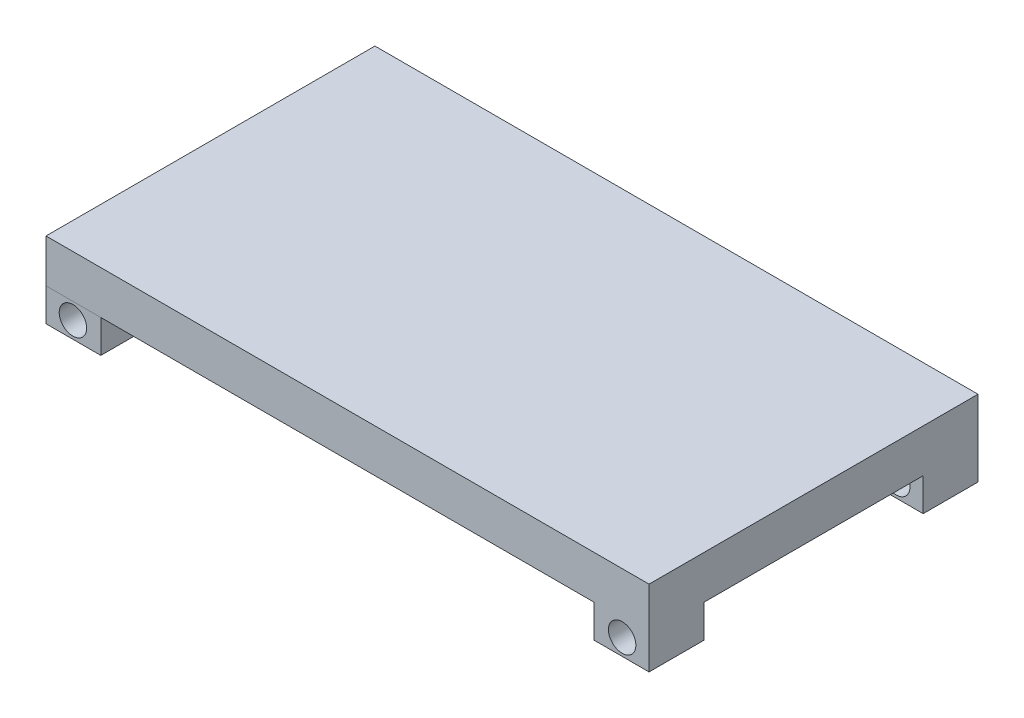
ISO-10303-21;
HEADER;
FILE_DESCRIPTION(('STEP AP214'),'2;1');
FILE_NAME('part.step','',(''),(''),'','','');
FILE_SCHEMA(('AUTOMOTIVE_DESIGN { 1 0 10303 214 1 1 1 1 }'));
ENDSEC;
DATA;
#1=APPLICATION_CONTEXT('core data for automotive mechanical design processes');
#2=APPLICATION_PROTOCOL_DEFINITION('international standard','automotive_design',2000,#1);
#3=PRODUCT_CONTEXT('',#1,'mechanical');
#4=PRODUCT('Part','Part','',(#3));
#5=PRODUCT_RELATED_PRODUCT_CATEGORY('part','',(#4));
#6=PRODUCT_DEFINITION_FORMATION('','',#4);
#7=PRODUCT_DEFINITION_CONTEXT('part definition',#1,'design');
#8=PRODUCT_DEFINITION('design','',#6,#7);
#9=PRODUCT_DEFINITION_SHAPE('','',#8);
#10=(LENGTH_UNIT() NAMED_UNIT(*) SI_UNIT(.MILLI.,.METRE.));
#11=(NAMED_UNIT(*) PLANE_ANGLE_UNIT() SI_UNIT($,.RADIAN.));
#12=(NAMED_UNIT(*) SI_UNIT($,.STERADIAN.) SOLID_ANGLE_UNIT());
#13=UNCERTAINTY_MEASURE_WITH_UNIT(LENGTH_MEASURE(1.E-05),#10,'distance_accuracy_value','');
#14=(GEOMETRIC_REPRESENTATION_CONTEXT(3) GLOBAL_UNCERTAINTY_ASSIGNED_CONTEXT((#13)) GLOBAL_UNIT_ASSIGNED_CONTEXT((#10,
#11,#12)) REPRESENTATION_CONTEXT('',''));
#15=CARTESIAN_POINT('',(0.,0.,0.));
#16=DIRECTION('',(0.,0.,1.));
#17=DIRECTION('',(1.,0.,0.));
#18=AXIS2_PLACEMENT_3D('',#15,#16,#17);
#19=CARTESIAN_POINT('',(0.,-7.62,-76.2));
#20=DIRECTION('',(1.,0.,0.));
#21=DIRECTION('',(0.,0.,1.));
#22=AXIS2_PLACEMENT_3D('',#19,#20,#21);
#23=PLANE('',#22);
#24=DIRECTION('',(0.,0.,1.));
#25=VECTOR('',#24,1.);
#26=CARTESIAN_POINT('',(0.,0.,-76.2));
#27=LINE('',#26,#25);
#28=CARTESIAN_POINT('',(0.,0.,-76.2));
#29=VERTEX_POINT('',#28);
#30=CARTESIAN_POINT('',(0.,0.,-63.5));
#31=VERTEX_POINT('',#30);
#32=EDGE_CURVE('E119',#29,#31,#27,.T.);
#33=ORIENTED_EDGE('',*,*,#32,.F.);
#34=DIRECTION('',(0.,1.,0.));
#35=VECTOR('',#34,1.);
#36=CARTESIAN_POINT('',(0.,-7.62,-76.2));
#37=LINE('',#36,#35);
#38=CARTESIAN_POINT('',(0.,-7.62,-76.2));
#39=VERTEX_POINT('',#38);
#40=EDGE_CURVE('E118',#39,#29,#37,.T.);
#41=ORIENTED_EDGE('',*,*,#40,.F.);
#42=DIRECTION('',(0.,0.,1.));
#43=VECTOR('',#42,1.);
#44=CARTESIAN_POINT('',(0.,-7.62,-76.2));
#45=LINE('',#44,#43);
#46=CARTESIAN_POINT('',(0.,-7.62,-63.5));
#47=VERTEX_POINT('',#46);
#48=EDGE_CURVE('E112',#39,#47,#45,.T.);
#49=ORIENTED_EDGE('',*,*,#48,.T.);
#50=DIRECTION('',(0.,1.,0.));
#51=VECTOR('',#50,1.);
#52=CARTESIAN_POINT('',(0.,-7.62,-63.5));
#53=LINE('',#52,#51);
#54=EDGE_CURVE('E12',#47,#31,#53,.T.);
#55=ORIENTED_EDGE('',*,*,#54,.T.);
#56=EDGE_LOOP('',(#33,#41,#49,#55));
#57=FACE_BOUND('',#56,.T.);
#58=ADVANCED_FACE('F55',(#57),#23,.F.);
#59=CARTESIAN_POINT('',(0.,-7.62,-63.5));
#60=DIRECTION('',(0.,0.,-1.));
#61=DIRECTION('',(1.,0.,0.));
#62=AXIS2_PLACEMENT_3D('',#59,#60,#61);
#63=PLANE('',#62);
#64=CARTESIAN_POINT('',(6.23439818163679,-3.81,-63.5));
#65=DIRECTION('',(0.,0.,1.));
#66=DIRECTION('',(1.,0.,0.));
#67=AXIS2_PLACEMENT_3D('',#64,#65,#66);
#68=CIRCLE('',#67,3.175);
#69=CARTESIAN_POINT('',(9.40939818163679,-3.81,-63.5));
#70=VERTEX_POINT('',#69);
#71=EDGE_CURVE('E122',#70,#70,#68,.F.);
#72=ORIENTED_EDGE('',*,*,#71,.T.);
#73=EDGE_LOOP('',(#72));
#74=FACE_BOUND('',#73,.T.);
#75=DIRECTION('',(1.,0.,0.));
#76=VECTOR('',#75,1.);
#77=CARTESIAN_POINT('',(0.,0.,-63.5));
#78=LINE('',#77,#76);
#79=CARTESIAN_POINT('',(12.7,0.,-63.5));
#80=VERTEX_POINT('',#79);
#81=EDGE_CURVE('E121',#31,#80,#78,.T.);
#82=ORIENTED_EDGE('',*,*,#81,.F.);
#83=ORIENTED_EDGE('',*,*,#54,.F.);
#84=DIRECTION('',(1.,0.,0.));
#85=VECTOR('',#84,1.);
#86=CARTESIAN_POINT('',(0.,-7.62,-63.5));
#87=LINE('',#86,#85);
#88=CARTESIAN_POINT('',(12.7,-7.62,-63.5));
#89=VERTEX_POINT('',#88);
#90=EDGE_CURVE('E96',#47,#89,#87,.T.);
#91=ORIENTED_EDGE('',*,*,#90,.T.);
#92=DIRECTION('',(0.,1.,0.));
#93=VECTOR('',#92,1.);
#94=CARTESIAN_POINT('',(12.7,-7.62,-63.5));
#95=LINE('',#94,#93);
#96=EDGE_CURVE('E63',#89,#80,#95,.T.);
#97=ORIENTED_EDGE('',*,*,#96,.T.);
#98=EDGE_LOOP('',(#82,#83,#91,#97));
#99=FACE_BOUND('',#98,.T.);
#100=ADVANCED_FACE('F110',(#74,#99),#63,.F.);
#101=CARTESIAN_POINT('',(12.7,-7.62,-76.2));
#102=DIRECTION('',(-1.,0.,0.));
#103=DIRECTION('',(0.,0.,-1.));
#104=AXIS2_PLACEMENT_3D('',#101,#102,#103);
#105=PLANE('',#104);
#106=DIRECTION('',(0.,0.,-1.));
#107=VECTOR('',#106,1.);
#108=CARTESIAN_POINT('',(12.7,0.,-76.2));
#109=LINE('',#108,#107);
#110=CARTESIAN_POINT('',(12.7,0.,-76.2));
#111=VERTEX_POINT('',#110);
#112=EDGE_CURVE('E106',#80,#111,#109,.T.);
#113=ORIENTED_EDGE('',*,*,#112,.F.);
#114=ORIENTED_EDGE('',*,*,#96,.F.);
#115=DIRECTION('',(0.,0.,-1.));
#116=VECTOR('',#115,1.);
#117=CARTESIAN_POINT('',(12.7,-7.62,-76.2));
#118=LINE('',#117,#116);
#119=CARTESIAN_POINT('',(12.7,-7.62,-76.2));
#120=VERTEX_POINT('',#119);
#121=EDGE_CURVE('E99',#89,#120,#118,.T.);
#122=ORIENTED_EDGE('',*,*,#121,.T.);
#123=DIRECTION('',(0.,1.,0.));
#124=VECTOR('',#123,1.);
#125=CARTESIAN_POINT('',(12.7,-7.62,-76.2));
#126=LINE('',#125,#124);
#127=EDGE_CURVE('E109',#120,#111,#126,.T.);
#128=ORIENTED_EDGE('',*,*,#127,.T.);
#129=EDGE_LOOP('',(#113,#114,#122,#128));
#130=FACE_BOUND('',#129,.T.);
#131=ADVANCED_FACE('F105',(#130),#105,.F.);
#132=CARTESIAN_POINT('',(0.,-7.62,-76.2));
#133=DIRECTION('',(0.,0.,1.));
#134=DIRECTION('',(-1.,0.,0.));
#135=AXIS2_PLACEMENT_3D('',#132,#133,#134);
#136=PLANE('',#135);
#137=CARTESIAN_POINT('',(6.23439818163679,-3.81,-76.2));
#138=DIRECTION('',(0.,0.,1.));
#139=DIRECTION('',(1.,0.,0.));
#140=AXIS2_PLACEMENT_3D('',#137,#138,#139);
#141=CIRCLE('',#140,3.175);
#142=CARTESIAN_POINT('',(9.40939818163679,-3.81,-76.2));
#143=VERTEX_POINT('',#142);
#144=EDGE_CURVE('E153',#143,#143,#141,.T.);
#145=ORIENTED_EDGE('',*,*,#144,.T.);
#146=EDGE_LOOP('',(#145));
#147=FACE_BOUND('',#146,.T.);
#148=DIRECTION('',(-1.,0.,0.));
#149=VECTOR('',#148,1.);
#150=CARTESIAN_POINT('',(0.,0.,-76.2));
#151=LINE('',#150,#149);
#152=EDGE_CURVE('E85',#111,#29,#151,.T.);
#153=ORIENTED_EDGE('',*,*,#152,.F.);
#154=ORIENTED_EDGE('',*,*,#127,.F.);
#155=DIRECTION('',(-1.,0.,0.));
#156=VECTOR('',#155,1.);
#157=CARTESIAN_POINT('',(0.,-7.62,-76.2));
#158=LINE('',#157,#156);
#159=EDGE_CURVE('E71',#120,#39,#158,.T.);
#160=ORIENTED_EDGE('',*,*,#159,.T.);
#161=ORIENTED_EDGE('',*,*,#40,.T.);
#162=EDGE_LOOP('',(#153,#154,#160,#161));
#163=FACE_BOUND('',#162,.T.);
#164=ADVANCED_FACE('F131',(#147,#163),#136,.F.);
#165=CARTESIAN_POINT('',(0.,-7.62,-76.2));
#166=DIRECTION('',(0.,-1.,0.));
#167=DIRECTION('',(0.,0.,1.));
#168=AXIS2_PLACEMENT_3D('',#165,#166,#167);
#169=PLANE('',#168);
#170=ORIENTED_EDGE('',*,*,#48,.F.);
#171=ORIENTED_EDGE('',*,*,#159,.F.);
#172=ORIENTED_EDGE('',*,*,#121,.F.);
#173=ORIENTED_EDGE('',*,*,#90,.F.);
#174=EDGE_LOOP('',(#170,#171,#172,#173));
#175=FACE_BOUND('',#174,.T.);
#176=ADVANCED_FACE('F101',(#175),#169,.T.);
#177=CARTESIAN_POINT('',(0.,0.,-76.2));
#178=DIRECTION('',(0.,-1.,0.));
#179=DIRECTION('',(0.,0.,1.));
#180=AXIS2_PLACEMENT_3D('',#177,#178,#179);
#181=PLANE('',#180);
#182=ORIENTED_EDGE('',*,*,#32,.T.);
#183=ORIENTED_EDGE('',*,*,#81,.T.);
#184=ORIENTED_EDGE('',*,*,#112,.T.);
#185=ORIENTED_EDGE('',*,*,#152,.T.);
#186=EDGE_LOOP('',(#182,#183,#184,#185));
#187=FACE_BOUND('',#186,.T.);
#188=ADVANCED_FACE('F127',(#187),#181,.F.);
#189=CARTESIAN_POINT('',(6.23439818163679,-3.81,0.001000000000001));
#190=DIRECTION('',(0.,0.,-1.));
#191=DIRECTION('',(1.,0.,0.));
#192=AXIS2_PLACEMENT_3D('',#189,#190,#191);
#193=CYLINDRICAL_SURFACE('',#192,3.175);
#194=ORIENTED_EDGE('',*,*,#144,.F.);
#195=EDGE_LOOP('',(#194));
#196=FACE_BOUND('',#195,.T.);
#197=ORIENTED_EDGE('',*,*,#71,.F.);
#198=EDGE_LOOP('',(#197));
#199=FACE_BOUND('',#198,.T.);
#200=ADVANCED_FACE('F157',(#196,#199),#193,.F.);
#201=CLOSED_SHELL('',(#58,#100,#131,#164,#176,#188,#200));
#202=MANIFOLD_SOLID_BREP('B2',#201);
#203=CARTESIAN_POINT('',(0.,-7.62,0.));
#204=DIRECTION('',(1.,0.,0.));
#205=DIRECTION('',(0.,0.,-1.));
#206=AXIS2_PLACEMENT_3D('',#203,#204,#205);
#207=PLANE('',#206);
#208=DIRECTION('',(0.,0.,-1.));
#209=VECTOR('',#208,1.);
#210=CARTESIAN_POINT('',(0.,0.,0.));
#211=LINE('',#210,#209);
#212=CARTESIAN_POINT('',(0.,0.,0.));
#213=VERTEX_POINT('',#212);
#214=CARTESIAN_POINT('',(0.,0.,-12.7));
#215=VERTEX_POINT('',#214);
#216=EDGE_CURVE('E271',#213,#215,#211,.T.);
#217=ORIENTED_EDGE('',*,*,#216,.T.);
#218=DIRECTION('',(0.,1.,0.));
#219=VECTOR('',#218,1.);
#220=CARTESIAN_POINT('',(0.,-7.62,-12.7));
#221=LINE('',#220,#219);
#222=CARTESIAN_POINT('',(0.,-7.62,-12.7));
#223=VERTEX_POINT('',#222);
#224=EDGE_CURVE('E53',#223,#215,#221,.T.);
#225=ORIENTED_EDGE('',*,*,#224,.F.);
#226=DIRECTION('',(0.,0.,-1.));
#227=VECTOR('',#226,1.);
#228=CARTESIAN_POINT('',(0.,-7.62,0.));
#229=LINE('',#228,#227);
#230=CARTESIAN_POINT('',(0.,-7.62,0.));
#231=VERTEX_POINT('',#230);
#232=EDGE_CURVE('E259',#231,#223,#229,.T.);
#233=ORIENTED_EDGE('',*,*,#232,.F.);
#234=DIRECTION('',(0.,1.,0.));
#235=VECTOR('',#234,1.);
#236=CARTESIAN_POINT('',(0.,-7.62,0.));
#237=LINE('',#236,#235);
#238=EDGE_CURVE('E267',#231,#213,#237,.T.);
#239=ORIENTED_EDGE('',*,*,#238,.T.);
#240=EDGE_LOOP('',(#217,#225,#233,#239));
#241=FACE_BOUND('',#240,.T.);
#242=ADVANCED_FACE('F208',(#241),#207,.F.);
#243=CARTESIAN_POINT('',(0.,-7.62,-12.7));
#244=DIRECTION('',(0.,0.,1.));
#245=DIRECTION('',(1.,0.,0.));
#246=AXIS2_PLACEMENT_3D('',#243,#244,#245);
#247=PLANE('',#246);
#248=CARTESIAN_POINT('',(6.23439818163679,-3.81,-12.7));
#249=DIRECTION('',(0.,0.,1.));
#250=DIRECTION('',(1.,0.,0.));
#251=AXIS2_PLACEMENT_3D('',#248,#249,#250);
#252=CIRCLE('',#251,3.175);
#253=CARTESIAN_POINT('',(9.40939818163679,-3.81,-12.7));
#254=VERTEX_POINT('',#253);
#255=EDGE_CURVE('E274',#254,#254,#252,.F.);
#256=ORIENTED_EDGE('',*,*,#255,.F.);
#257=EDGE_LOOP('',(#256));
#258=FACE_BOUND('',#257,.T.);
#259=DIRECTION('',(1.,0.,0.));
#260=VECTOR('',#259,1.);
#261=CARTESIAN_POINT('',(0.,0.,-12.7));
#262=LINE('',#261,#260);
#263=CARTESIAN_POINT('',(12.7,0.,-12.7));
#264=VERTEX_POINT('',#263);
#265=EDGE_CURVE('E263',#215,#264,#262,.T.);
#266=ORIENTED_EDGE('',*,*,#265,.T.);
#267=DIRECTION('',(0.,1.,0.));
#268=VECTOR('',#267,1.);
#269=CARTESIAN_POINT('',(12.7,-7.62,-12.7));
#270=LINE('',#269,#268);
#271=CARTESIAN_POINT('',(12.7,-7.62,-12.7));
#272=VERTEX_POINT('',#271);
#273=EDGE_CURVE('E216',#272,#264,#270,.T.);
#274=ORIENTED_EDGE('',*,*,#273,.F.);
#275=DIRECTION('',(1.,0.,0.));
#276=VECTOR('',#275,1.);
#277=CARTESIAN_POINT('',(0.,-7.62,-12.7));
#278=LINE('',#277,#276);
#279=EDGE_CURVE('E254',#223,#272,#278,.T.);
#280=ORIENTED_EDGE('',*,*,#279,.F.);
#281=ORIENTED_EDGE('',*,*,#224,.T.);
#282=EDGE_LOOP('',(#266,#274,#280,#281));
#283=FACE_BOUND('',#282,.T.);
#284=ADVANCED_FACE('F262',(#258,#283),#247,.F.);
#285=CARTESIAN_POINT('',(12.7,-7.62,0.));
#286=DIRECTION('',(-1.,0.,0.));
#287=DIRECTION('',(0.,0.,1.));
#288=AXIS2_PLACEMENT_3D('',#285,#286,#287);
#289=PLANE('',#288);
#290=DIRECTION('',(0.,0.,1.));
#291=VECTOR('',#290,1.);
#292=CARTESIAN_POINT('',(12.7,0.,0.));
#293=LINE('',#292,#291);
#294=CARTESIAN_POINT('',(12.7,0.,0.));
#295=VERTEX_POINT('',#294);
#296=EDGE_CURVE('E241',#264,#295,#293,.T.);
#297=ORIENTED_EDGE('',*,*,#296,.T.);
#298=DIRECTION('',(0.,1.,0.));
#299=VECTOR('',#298,1.);
#300=CARTESIAN_POINT('',(12.7,-7.62,0.));
#301=LINE('',#300,#299);
#302=CARTESIAN_POINT('',(12.7,-7.62,0.));
#303=VERTEX_POINT('',#302);
#304=EDGE_CURVE('E264',#303,#295,#301,.T.);
#305=ORIENTED_EDGE('',*,*,#304,.F.);
#306=DIRECTION('',(0.,0.,1.));
#307=VECTOR('',#306,1.);
#308=CARTESIAN_POINT('',(12.7,-7.62,0.));
#309=LINE('',#308,#307);
#310=EDGE_CURVE('E257',#272,#303,#309,.T.);
#311=ORIENTED_EDGE('',*,*,#310,.F.);
#312=ORIENTED_EDGE('',*,*,#273,.T.);
#313=EDGE_LOOP('',(#297,#305,#311,#312));
#314=FACE_BOUND('',#313,.T.);
#315=ADVANCED_FACE('F265',(#314),#289,.F.);
#316=CARTESIAN_POINT('',(0.,-7.62,0.));
#317=DIRECTION('',(0.,0.,-1.));
#318=DIRECTION('',(-1.,0.,0.));
#319=AXIS2_PLACEMENT_3D('',#316,#317,#318);
#320=PLANE('',#319);
#321=CARTESIAN_POINT('',(6.23439818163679,-3.81,0.));
#322=DIRECTION('',(0.,0.,1.));
#323=DIRECTION('',(1.,0.,0.));
#324=AXIS2_PLACEMENT_3D('',#321,#322,#323);
#325=CIRCLE('',#324,3.175);
#326=CARTESIAN_POINT('',(9.40939818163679,-3.81,0.));
#327=VERTEX_POINT('',#326);
#328=EDGE_CURVE('E287',#327,#327,#325,.T.);
#329=ORIENTED_EDGE('',*,*,#328,.F.);
#330=EDGE_LOOP('',(#329));
#331=FACE_BOUND('',#330,.T.);
#332=DIRECTION('',(-1.,0.,0.));
#333=VECTOR('',#332,1.);
#334=CARTESIAN_POINT('',(0.,0.,0.));
#335=LINE('',#334,#333);
#336=EDGE_CURVE('E247',#295,#213,#335,.T.);
#337=ORIENTED_EDGE('',*,*,#336,.T.);
#338=ORIENTED_EDGE('',*,*,#238,.F.);
#339=DIRECTION('',(-1.,0.,0.));
#340=VECTOR('',#339,1.);
#341=CARTESIAN_POINT('',(0.,-7.62,0.));
#342=LINE('',#341,#340);
#343=EDGE_CURVE('E224',#303,#231,#342,.T.);
#344=ORIENTED_EDGE('',*,*,#343,.F.);
#345=ORIENTED_EDGE('',*,*,#304,.T.);
#346=EDGE_LOOP('',(#337,#338,#344,#345));
#347=FACE_BOUND('',#346,.T.);
#348=ADVANCED_FACE('F279',(#331,#347),#320,.F.);
#349=CARTESIAN_POINT('',(0.,-7.62,0.));
#350=DIRECTION('',(0.,-1.,0.));
#351=DIRECTION('',(0.,0.,-1.));
#352=AXIS2_PLACEMENT_3D('',#349,#350,#351);
#353=PLANE('',#352);
#354=ORIENTED_EDGE('',*,*,#232,.T.);
#355=ORIENTED_EDGE('',*,*,#279,.T.);
#356=ORIENTED_EDGE('',*,*,#310,.T.);
#357=ORIENTED_EDGE('',*,*,#343,.T.);
#358=EDGE_LOOP('',(#354,#355,#356,#357));
#359=FACE_BOUND('',#358,.T.);
#360=ADVANCED_FACE('F255',(#359),#353,.T.);
#361=CARTESIAN_POINT('',(0.,0.,0.));
#362=DIRECTION('',(0.,-1.,0.));
#363=DIRECTION('',(0.,0.,-1.));
#364=AXIS2_PLACEMENT_3D('',#361,#362,#363);
#365=PLANE('',#364);
#366=ORIENTED_EDGE('',*,*,#216,.F.);
#367=ORIENTED_EDGE('',*,*,#336,.F.);
#368=ORIENTED_EDGE('',*,*,#296,.F.);
#369=ORIENTED_EDGE('',*,*,#265,.F.);
#370=EDGE_LOOP('',(#366,#367,#368,#369));
#371=FACE_BOUND('',#370,.T.);
#372=ADVANCED_FACE('F282',(#371),#365,.F.);
#373=CARTESIAN_POINT('',(6.23439818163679,-3.81,-76.201));
#374=DIRECTION('',(0.,0.,1.));
#375=DIRECTION('',(1.,0.,0.));
#376=AXIS2_PLACEMENT_3D('',#373,#374,#375);
#377=CYLINDRICAL_SURFACE('',#376,3.175);
#378=ORIENTED_EDGE('',*,*,#328,.T.);
#379=EDGE_LOOP('',(#378));
#380=FACE_BOUND('',#379,.T.);
#381=ORIENTED_EDGE('',*,*,#255,.T.);
#382=EDGE_LOOP('',(#381));
#383=FACE_BOUND('',#382,.T.);
#384=ADVANCED_FACE('F291',(#380,#383),#377,.F.);
#385=CLOSED_SHELL('',(#242,#284,#315,#348,#360,#372,#384));
#386=MANIFOLD_SOLID_BREP('B6',#385);
#387=CARTESIAN_POINT('',(0.,0.,-76.2));
#388=DIRECTION('',(0.,-1.,0.));
#389=DIRECTION('',(0.,0.,-1.));
#390=AXIS2_PLACEMENT_3D('',#387,#388,#389);
#391=PLANE('',#390);
#392=DIRECTION('',(0.,0.,-1.));
#393=VECTOR('',#392,1.);
#394=CARTESIAN_POINT('',(127.,0.,-76.2));
#395=LINE('',#394,#393);
#396=CARTESIAN_POINT('',(127.,0.,-63.5));
#397=VERTEX_POINT('',#396);
#398=CARTESIAN_POINT('',(127.,0.,-76.2));
#399=VERTEX_POINT('',#398);
#400=EDGE_CURVE('E370',#397,#399,#395,.T.);
#401=ORIENTED_EDGE('',*,*,#400,.F.);
#402=DIRECTION('',(-1.,0.,0.));
#403=VECTOR('',#402,1.);
#404=CARTESIAN_POINT('',(139.7,0.,-63.5));
#405=LINE('',#404,#403);
#406=CARTESIAN_POINT('',(139.7,0.,-63.5));
#407=VERTEX_POINT('',#406);
#408=EDGE_CURVE('E375',#407,#397,#405,.T.);
#409=ORIENTED_EDGE('',*,*,#408,.F.);
#410=DIRECTION('',(0.,0.,1.));
#411=VECTOR('',#410,1.);
#412=CARTESIAN_POINT('',(139.7,0.,-76.2));
#413=LINE('',#412,#411);
#414=CARTESIAN_POINT('',(139.7,0.,-12.7));
#415=VERTEX_POINT('',#414);
#416=EDGE_CURVE('E554',#407,#415,#413,.T.);
#417=ORIENTED_EDGE('',*,*,#416,.T.);
#418=DIRECTION('',(-1.,0.,0.));
#419=VECTOR('',#418,1.);
#420=CARTESIAN_POINT('',(139.7,0.,-12.7));
#421=LINE('',#420,#419);
#422=CARTESIAN_POINT('',(127.,0.,-12.7));
#423=VERTEX_POINT('',#422);
#424=EDGE_CURVE('E498',#415,#423,#421,.T.);
#425=ORIENTED_EDGE('',*,*,#424,.T.);
#426=DIRECTION('',(0.,0.,1.));
#427=VECTOR('',#426,1.);
#428=CARTESIAN_POINT('',(127.,0.,0.));
#429=LINE('',#428,#427);
#430=CARTESIAN_POINT('',(127.,0.,0.));
#431=VERTEX_POINT('',#430);
#432=EDGE_CURVE('E510',#423,#431,#429,.T.);
#433=ORIENTED_EDGE('',*,*,#432,.T.);
#434=DIRECTION('',(1.,0.,0.));
#435=VECTOR('',#434,1.);
#436=CARTESIAN_POINT('',(0.,0.,0.));
#437=LINE('',#436,#435);
#438=CARTESIAN_POINT('',(0.,0.,0.));
#439=VERTEX_POINT('',#438);
#440=EDGE_CURVE('E542',#439,#431,#437,.T.);
#441=ORIENTED_EDGE('',*,*,#440,.F.);
#442=DIRECTION('',(0.,0.,1.));
#443=VECTOR('',#442,1.);
#444=CARTESIAN_POINT('',(0.,0.,-76.2));
#445=LINE('',#444,#443);
#446=CARTESIAN_POINT('',(0.,0.,-76.2));
#447=VERTEX_POINT('',#446);
#448=EDGE_CURVE('E356',#447,#439,#445,.T.);
#449=ORIENTED_EDGE('',*,*,#448,.F.);
#450=DIRECTION('',(1.,0.,0.));
#451=VECTOR('',#450,1.);
#452=CARTESIAN_POINT('',(0.,0.,-76.2));
#453=LINE('',#452,#451);
#454=EDGE_CURVE('E443',#447,#399,#453,.T.);
#455=ORIENTED_EDGE('',*,*,#454,.T.);
#456=EDGE_LOOP('',(#401,#409,#417,#425,#433,#441,#449,#455));
#457=FACE_BOUND('',#456,.T.);
#458=ADVANCED_FACE('F352',(#457),#391,.T.);
#459=CARTESIAN_POINT('',(0.,0.,-76.2));
#460=DIRECTION('',(-1.,0.,0.));
#461=DIRECTION('',(0.,0.,1.));
#462=AXIS2_PLACEMENT_3D('',#459,#460,#461);
#463=PLANE('',#462);
#464=DIRECTION('',(0.,-1.,0.));
#465=VECTOR('',#464,1.);
#466=CARTESIAN_POINT('',(0.,0.,0.));
#467=LINE('',#466,#465);
#468=CARTESIAN_POINT('',(0.,10.0000054,0.));
#469=VERTEX_POINT('',#468);
#470=EDGE_CURVE('E529',#469,#439,#467,.T.);
#471=ORIENTED_EDGE('',*,*,#470,.F.);
#472=DIRECTION('',(0.,0.,1.));
#473=VECTOR('',#472,1.);
#474=CARTESIAN_POINT('',(0.,10.0000054,-76.2));
#475=LINE('',#474,#473);
#476=CARTESIAN_POINT('',(0.,10.0000054,-76.2));
#477=VERTEX_POINT('',#476);
#478=EDGE_CURVE('E206',#477,#469,#475,.T.);
#479=ORIENTED_EDGE('',*,*,#478,.F.);
#480=DIRECTION('',(0.,-1.,0.));
#481=VECTOR('',#480,1.);
#482=CARTESIAN_POINT('',(0.,0.,-76.2));
#483=LINE('',#482,#481);
#484=EDGE_CURVE('E530',#477,#447,#483,.T.);
#485=ORIENTED_EDGE('',*,*,#484,.T.);
#486=ORIENTED_EDGE('',*,*,#448,.T.);
#487=EDGE_LOOP('',(#471,#479,#485,#486));
#488=FACE_BOUND('',#487,.T.);
#489=ADVANCED_FACE('F354',(#488),#463,.T.);
#490=CARTESIAN_POINT('',(0.,10.0000054,-76.2));
#491=DIRECTION('',(0.,1.,0.));
#492=DIRECTION('',(0.,0.,1.));
#493=AXIS2_PLACEMENT_3D('',#490,#491,#492);
#494=PLANE('',#493);
#495=DIRECTION('',(-1.,0.,0.));
#496=VECTOR('',#495,1.);
#497=CARTESIAN_POINT('',(0.,10.0000054,0.));
#498=LINE('',#497,#496);
#499=CARTESIAN_POINT('',(139.7,10.0000054,0.));
#500=VERTEX_POINT('',#499);
#501=EDGE_CURVE('E534',#500,#469,#498,.T.);
#502=ORIENTED_EDGE('',*,*,#501,.F.);
#503=DIRECTION('',(0.,0.,1.));
#504=VECTOR('',#503,1.);
#505=CARTESIAN_POINT('',(139.7,10.0000054,-76.2));
#506=LINE('',#505,#504);
#507=CARTESIAN_POINT('',(139.7,10.0000054,-76.2));
#508=VERTEX_POINT('',#507);
#509=EDGE_CURVE('E362',#508,#500,#506,.T.);
#510=ORIENTED_EDGE('',*,*,#509,.F.);
#511=DIRECTION('',(-1.,0.,0.));
#512=VECTOR('',#511,1.);
#513=CARTESIAN_POINT('',(0.,10.0000054,-76.2));
#514=LINE('',#513,#512);
#515=EDGE_CURVE('E439',#508,#477,#514,.T.);
#516=ORIENTED_EDGE('',*,*,#515,.T.);
#517=ORIENTED_EDGE('',*,*,#478,.T.);
#518=EDGE_LOOP('',(#502,#510,#516,#517));
#519=FACE_BOUND('',#518,.T.);
#520=ADVANCED_FACE('F568',(#519),#494,.T.);
#521=CARTESIAN_POINT('',(139.7,0.,-76.2));
#522=DIRECTION('',(1.,0.,0.));
#523=DIRECTION('',(0.,0.,-1.));
#524=AXIS2_PLACEMENT_3D('',#521,#522,#523);
#525=PLANE('',#524);
#526=DIRECTION('',(0.,1.,0.));
#527=VECTOR('',#526,1.);
#528=CARTESIAN_POINT('',(139.7,0.,0.));
#529=LINE('',#528,#527);
#530=CARTESIAN_POINT('',(139.7,-7.62,0.));
#531=VERTEX_POINT('',#530);
#532=EDGE_CURVE('E546',#531,#500,#529,.T.);
#533=ORIENTED_EDGE('',*,*,#532,.F.);
#534=DIRECTION('',(0.,0.,-1.));
#535=VECTOR('',#534,1.);
#536=CARTESIAN_POINT('',(139.7,-7.62,0.));
#537=LINE('',#536,#535);
#538=CARTESIAN_POINT('',(139.7,-7.62,-12.7));
#539=VERTEX_POINT('',#538);
#540=EDGE_CURVE('E490',#531,#539,#537,.T.);
#541=ORIENTED_EDGE('',*,*,#540,.T.);
#542=DIRECTION('',(0.,1.,0.));
#543=VECTOR('',#542,1.);
#544=CARTESIAN_POINT('',(139.7,-7.62,-12.7));
#545=LINE('',#544,#543);
#546=EDGE_CURVE('E454',#539,#415,#545,.T.);
#547=ORIENTED_EDGE('',*,*,#546,.T.);
#548=ORIENTED_EDGE('',*,*,#416,.F.);
#549=DIRECTION('',(0.,1.,0.));
#550=VECTOR('',#549,1.);
#551=CARTESIAN_POINT('',(139.7,-7.62,-63.5));
#552=LINE('',#551,#550);
#553=CARTESIAN_POINT('',(139.7,-7.62,-63.5));
#554=VERTEX_POINT('',#553);
#555=EDGE_CURVE('E459',#554,#407,#552,.T.);
#556=ORIENTED_EDGE('',*,*,#555,.F.);
#557=DIRECTION('',(0.,0.,1.));
#558=VECTOR('',#557,1.);
#559=CARTESIAN_POINT('',(139.7,-7.62,-76.2));
#560=LINE('',#559,#558);
#561=CARTESIAN_POINT('',(139.7,-7.62,-76.2));
#562=VERTEX_POINT('',#561);
#563=EDGE_CURVE('E449',#562,#554,#560,.T.);
#564=ORIENTED_EDGE('',*,*,#563,.F.);
#565=DIRECTION('',(0.,1.,0.));
#566=VECTOR('',#565,1.);
#567=CARTESIAN_POINT('',(139.7,0.,-76.2));
#568=LINE('',#567,#566);
#569=EDGE_CURVE('E430',#562,#508,#568,.T.);
#570=ORIENTED_EDGE('',*,*,#569,.T.);
#571=ORIENTED_EDGE('',*,*,#509,.T.);
#572=EDGE_LOOP('',(#533,#541,#547,#548,#556,#564,#570,#571));
#573=FACE_BOUND('',#572,.T.);
#574=ADVANCED_FACE('F457',(#573),#525,.T.);
#575=CARTESIAN_POINT('',(0.,0.,-76.2));
#576=DIRECTION('',(0.,0.,-1.));
#577=DIRECTION('',(-1.,0.,0.));
#578=AXIS2_PLACEMENT_3D('',#575,#576,#577);
#579=PLANE('',#578);
#580=ORIENTED_EDGE('',*,*,#484,.F.);
#581=ORIENTED_EDGE('',*,*,#515,.F.);
#582=ORIENTED_EDGE('',*,*,#569,.F.);
#583=DIRECTION('',(1.,0.,0.));
#584=VECTOR('',#583,1.);
#585=CARTESIAN_POINT('',(139.7,-7.62,-76.2));
#586=LINE('',#585,#584);
#587=CARTESIAN_POINT('',(127.,-7.62,-76.2));
#588=VERTEX_POINT('',#587);
#589=EDGE_CURVE('E436',#588,#562,#586,.T.);
#590=ORIENTED_EDGE('',*,*,#589,.F.);
#591=DIRECTION('',(0.,1.,0.));
#592=VECTOR('',#591,1.);
#593=CARTESIAN_POINT('',(127.,-7.62,-76.2));
#594=LINE('',#593,#592);
#595=EDGE_CURVE('E481',#588,#399,#594,.T.);
#596=ORIENTED_EDGE('',*,*,#595,.T.);
#597=ORIENTED_EDGE('',*,*,#454,.F.);
#598=EDGE_LOOP('',(#580,#581,#582,#590,#596,#597));
#599=FACE_BOUND('',#598,.T.);
#600=CARTESIAN_POINT('',(133.465601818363,-3.81,-76.2));
#601=DIRECTION('',(0.,0.,-1.));
#602=DIRECTION('',(-1.,0.,0.));
#603=AXIS2_PLACEMENT_3D('',#600,#601,#602);
#604=CIRCLE('',#603,3.175);
#605=CARTESIAN_POINT('',(130.290601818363,-3.81,-76.2));
#606=VERTEX_POINT('',#605);
#607=EDGE_CURVE('E455',#606,#606,#604,.T.);
#608=ORIENTED_EDGE('',*,*,#607,.F.);
#609=EDGE_LOOP('',(#608));
#610=FACE_BOUND('',#609,.T.);
#611=ADVANCED_FACE('F433',(#599,#610),#579,.T.);
#612=CARTESIAN_POINT('',(0.,0.,0.));
#613=DIRECTION('',(0.,0.,-1.));
#614=DIRECTION('',(-1.,0.,0.));
#615=AXIS2_PLACEMENT_3D('',#612,#613,#614);
#616=PLANE('',#615);
#617=ORIENTED_EDGE('',*,*,#470,.T.);
#618=ORIENTED_EDGE('',*,*,#440,.T.);
#619=DIRECTION('',(0.,1.,0.));
#620=VECTOR('',#619,1.);
#621=CARTESIAN_POINT('',(127.,-7.62,0.));
#622=LINE('',#621,#620);
#623=CARTESIAN_POINT('',(127.,-7.62,0.));
#624=VERTEX_POINT('',#623);
#625=EDGE_CURVE('E514',#624,#431,#622,.T.);
#626=ORIENTED_EDGE('',*,*,#625,.F.);
#627=DIRECTION('',(1.,0.,0.));
#628=VECTOR('',#627,1.);
#629=CARTESIAN_POINT('',(139.7,-7.62,0.));
#630=LINE('',#629,#628);
#631=EDGE_CURVE('E525',#624,#531,#630,.T.);
#632=ORIENTED_EDGE('',*,*,#631,.T.);
#633=ORIENTED_EDGE('',*,*,#532,.T.);
#634=ORIENTED_EDGE('',*,*,#501,.T.);
#635=EDGE_LOOP('',(#617,#618,#626,#632,#633,#634));
#636=FACE_BOUND('',#635,.T.);
#637=CARTESIAN_POINT('',(133.465601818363,-3.81,0.));
#638=DIRECTION('',(0.,0.,-1.));
#639=DIRECTION('',(-1.,0.,0.));
#640=AXIS2_PLACEMENT_3D('',#637,#638,#639);
#641=CIRCLE('',#640,3.175);
#642=CARTESIAN_POINT('',(130.290601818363,-3.81,0.));
#643=VERTEX_POINT('',#642);
#644=EDGE_CURVE('E521',#643,#643,#641,.T.);
#645=ORIENTED_EDGE('',*,*,#644,.T.);
#646=EDGE_LOOP('',(#645));
#647=FACE_BOUND('',#646,.T.);
#648=ADVANCED_FACE('F564',(#636,#647),#616,.F.);
#649=CARTESIAN_POINT('',(139.7,-7.62,-12.7));
#650=DIRECTION('',(0.,0.,1.));
#651=DIRECTION('',(-1.,0.,0.));
#652=AXIS2_PLACEMENT_3D('',#649,#650,#651);
#653=PLANE('',#652);
#654=CARTESIAN_POINT('',(133.465601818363,-3.81,-12.7));
#655=DIRECTION('',(0.,0.,-1.));
#656=DIRECTION('',(-1.,0.,0.));
#657=AXIS2_PLACEMENT_3D('',#654,#655,#656);
#658=CIRCLE('',#657,3.175);
#659=CARTESIAN_POINT('',(130.290601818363,-3.81,-12.7));
#660=VERTEX_POINT('',#659);
#661=EDGE_CURVE('E494',#660,#660,#658,.F.);
#662=ORIENTED_EDGE('',*,*,#661,.T.);
#663=EDGE_LOOP('',(#662));
#664=FACE_BOUND('',#663,.T.);
#665=ORIENTED_EDGE('',*,*,#424,.F.);
#666=ORIENTED_EDGE('',*,*,#546,.F.);
#667=DIRECTION('',(-1.,0.,0.));
#668=VECTOR('',#667,1.);
#669=CARTESIAN_POINT('',(139.7,-7.62,-12.7));
#670=LINE('',#669,#668);
#671=CARTESIAN_POINT('',(127.,-7.62,-12.7));
#672=VERTEX_POINT('',#671);
#673=EDGE_CURVE('E506',#539,#672,#670,.T.);
#674=ORIENTED_EDGE('',*,*,#673,.T.);
#675=DIRECTION('',(0.,1.,0.));
#676=VECTOR('',#675,1.);
#677=CARTESIAN_POINT('',(127.,-7.62,-12.7));
#678=LINE('',#677,#676);
#679=EDGE_CURVE('E502',#672,#423,#678,.T.);
#680=ORIENTED_EDGE('',*,*,#679,.T.);
#681=EDGE_LOOP('',(#665,#666,#674,#680));
#682=FACE_BOUND('',#681,.T.);
#683=ADVANCED_FACE('F598',(#664,#682),#653,.F.);
#684=CARTESIAN_POINT('',(127.,-7.62,0.));
#685=DIRECTION('',(1.,0.,0.));
#686=DIRECTION('',(0.,0.,1.));
#687=AXIS2_PLACEMENT_3D('',#684,#685,#686);
#688=PLANE('',#687);
#689=ORIENTED_EDGE('',*,*,#432,.F.);
#690=ORIENTED_EDGE('',*,*,#679,.F.);
#691=DIRECTION('',(0.,0.,1.));
#692=VECTOR('',#691,1.);
#693=CARTESIAN_POINT('',(127.,-7.62,0.));
#694=LINE('',#693,#692);
#695=EDGE_CURVE('E517',#672,#624,#694,.T.);
#696=ORIENTED_EDGE('',*,*,#695,.T.);
#697=ORIENTED_EDGE('',*,*,#625,.T.);
#698=EDGE_LOOP('',(#689,#690,#696,#697));
#699=FACE_BOUND('',#698,.T.);
#700=ADVANCED_FACE('F603',(#699),#688,.F.);
#701=CARTESIAN_POINT('',(139.7,-7.62,0.));
#702=DIRECTION('',(0.,-1.,0.));
#703=DIRECTION('',(0.,0.,-1.));
#704=AXIS2_PLACEMENT_3D('',#701,#702,#703);
#705=PLANE('',#704);
#706=ORIENTED_EDGE('',*,*,#540,.F.);
#707=ORIENTED_EDGE('',*,*,#631,.F.);
#708=ORIENTED_EDGE('',*,*,#695,.F.);
#709=ORIENTED_EDGE('',*,*,#673,.F.);
#710=EDGE_LOOP('',(#706,#707,#708,#709));
#711=FACE_BOUND('',#710,.T.);
#712=ADVANCED_FACE('F583',(#711),#705,.T.);
#713=CARTESIAN_POINT('',(133.465601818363,-3.81,-76.201));
#714=DIRECTION('',(0.,0.,1.));
#715=DIRECTION('',(-1.,0.,0.));
#716=AXIS2_PLACEMENT_3D('',#713,#714,#715);
#717=CYLINDRICAL_SURFACE('',#716,3.175);
#718=ORIENTED_EDGE('',*,*,#644,.F.);
#719=EDGE_LOOP('',(#718));
#720=FACE_BOUND('',#719,.T.);
#721=ORIENTED_EDGE('',*,*,#661,.F.);
#722=EDGE_LOOP('',(#721));
#723=FACE_BOUND('',#722,.T.);
#724=ADVANCED_FACE('F575',(#720,#723),#717,.F.);
#725=CARTESIAN_POINT('',(139.7,-7.62,-63.5));
#726=DIRECTION('',(0.,0.,-1.));
#727=DIRECTION('',(-1.,0.,0.));
#728=AXIS2_PLACEMENT_3D('',#725,#726,#727);
#729=PLANE('',#728);
#730=CARTESIAN_POINT('',(133.465601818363,-3.81,-63.5));
#731=DIRECTION('',(0.,0.,-1.));
#732=DIRECTION('',(-1.,0.,0.));
#733=AXIS2_PLACEMENT_3D('',#730,#731,#732);
#734=CIRCLE('',#733,3.175);
#735=CARTESIAN_POINT('',(130.290601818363,-3.81,-63.5));
#736=VERTEX_POINT('',#735);
#737=EDGE_CURVE('E463',#736,#736,#734,.F.);
#738=ORIENTED_EDGE('',*,*,#737,.F.);
#739=EDGE_LOOP('',(#738));
#740=FACE_BOUND('',#739,.T.);
#741=ORIENTED_EDGE('',*,*,#408,.T.);
#742=DIRECTION('',(0.,1.,0.));
#743=VECTOR('',#742,1.);
#744=CARTESIAN_POINT('',(127.,-7.62,-63.5));
#745=LINE('',#744,#743);
#746=CARTESIAN_POINT('',(127.,-7.62,-63.5));
#747=VERTEX_POINT('',#746);
#748=EDGE_CURVE('E474',#747,#397,#745,.T.);
#749=ORIENTED_EDGE('',*,*,#748,.F.);
#750=DIRECTION('',(-1.,0.,0.));
#751=VECTOR('',#750,1.);
#752=CARTESIAN_POINT('',(139.7,-7.62,-63.5));
#753=LINE('',#752,#751);
#754=EDGE_CURVE('E471',#554,#747,#753,.T.);
#755=ORIENTED_EDGE('',*,*,#754,.F.);
#756=ORIENTED_EDGE('',*,*,#555,.T.);
#757=EDGE_LOOP('',(#741,#749,#755,#756));
#758=FACE_BOUND('',#757,.T.);
#759=ADVANCED_FACE('F573',(#740,#758),#729,.F.);
#760=CARTESIAN_POINT('',(127.,-7.62,-76.2));
#761=DIRECTION('',(1.,0.,0.));
#762=DIRECTION('',(0.,0.,-1.));
#763=AXIS2_PLACEMENT_3D('',#760,#761,#762);
#764=PLANE('',#763);
#765=ORIENTED_EDGE('',*,*,#400,.T.);
#766=ORIENTED_EDGE('',*,*,#595,.F.);
#767=DIRECTION('',(0.,0.,-1.));
#768=VECTOR('',#767,1.);
#769=CARTESIAN_POINT('',(127.,-7.62,-76.2));
#770=LINE('',#769,#768);
#771=EDGE_CURVE('E451',#747,#588,#770,.T.);
#772=ORIENTED_EDGE('',*,*,#771,.F.);
#773=ORIENTED_EDGE('',*,*,#748,.T.);
#774=EDGE_LOOP('',(#765,#766,#772,#773));
#775=FACE_BOUND('',#774,.T.);
#776=ADVANCED_FACE('F570',(#775),#764,.F.);
#777=CARTESIAN_POINT('',(139.7,-7.62,-76.2));
#778=DIRECTION('',(0.,-1.,0.));
#779=DIRECTION('',(0.,0.,1.));
#780=AXIS2_PLACEMENT_3D('',#777,#778,#779);
#781=PLANE('',#780);
#782=ORIENTED_EDGE('',*,*,#563,.T.);
#783=ORIENTED_EDGE('',*,*,#754,.T.);
#784=ORIENTED_EDGE('',*,*,#771,.T.);
#785=ORIENTED_EDGE('',*,*,#589,.T.);
#786=EDGE_LOOP('',(#782,#783,#784,#785));
#787=FACE_BOUND('',#786,.T.);
#788=ADVANCED_FACE('F447',(#787),#781,.T.);
#789=CARTESIAN_POINT('',(133.465601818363,-3.81,0.001000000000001));
#790=DIRECTION('',(0.,0.,-1.));
#791=DIRECTION('',(-1.,0.,0.));
#792=AXIS2_PLACEMENT_3D('',#789,#790,#791);
#793=CYLINDRICAL_SURFACE('',#792,3.175);
#794=ORIENTED_EDGE('',*,*,#607,.T.);
#795=EDGE_LOOP('',(#794));
#796=FACE_BOUND('',#795,.T.);
#797=ORIENTED_EDGE('',*,*,#737,.T.);
#798=EDGE_LOOP('',(#797));
#799=FACE_BOUND('',#798,.T.);
#800=ADVANCED_FACE('F611',(#796,#799),#793,.F.);
#801=CLOSED_SHELL('',(#458,#489,#520,#574,#611,#648,#683,#700,#712,#724,#759,#776,#788,#800));
#802=MANIFOLD_SOLID_BREP('B47',#801);
#803=ADVANCED_BREP_SHAPE_REPRESENTATION('',(#18,#202,#386,#802),#14);
#804=SHAPE_DEFINITION_REPRESENTATION(#9,#803);
ENDSEC;
END-ISO-10303-21;
